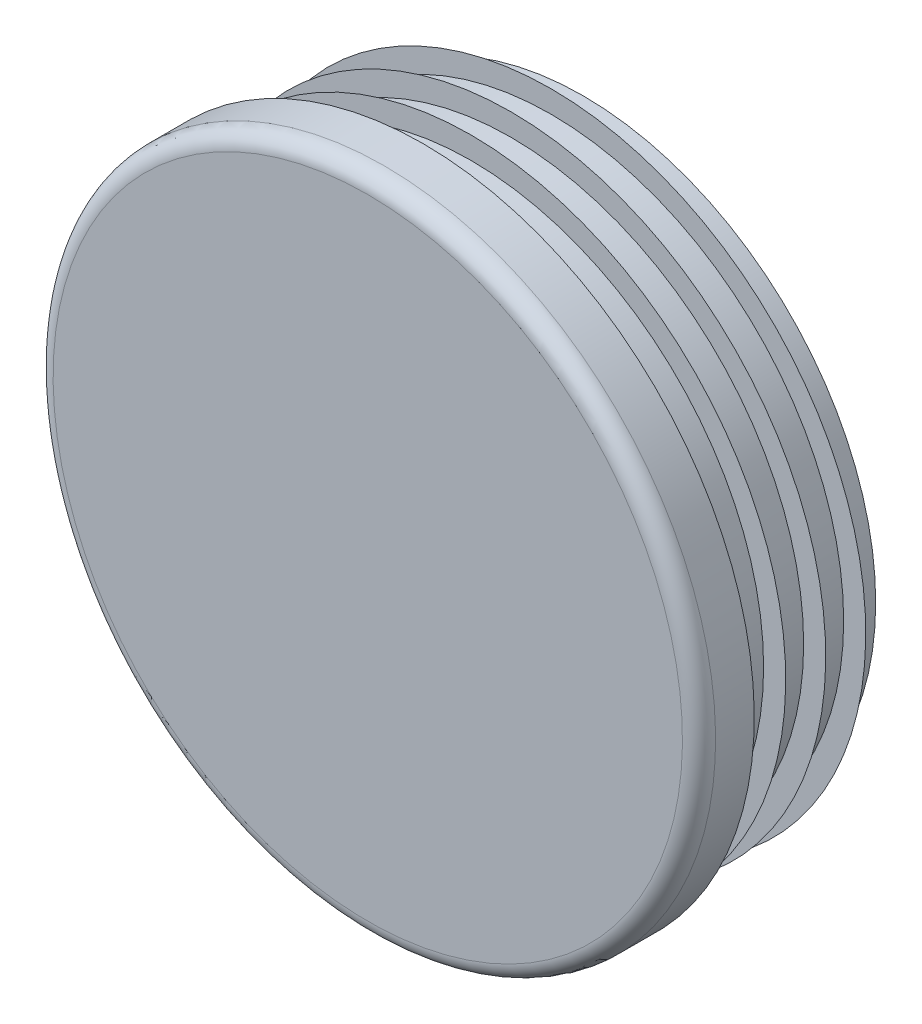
ISO-10303-21;
HEADER;
FILE_DESCRIPTION(('STEP AP214'),'2;1');
FILE_NAME('part.step','',(''),(''),'','','');
FILE_SCHEMA(('AUTOMOTIVE_DESIGN { 1 0 10303 214 1 1 1 1 }'));
ENDSEC;
DATA;
#1=APPLICATION_CONTEXT('core data for automotive mechanical design processes');
#2=APPLICATION_PROTOCOL_DEFINITION('international standard','automotive_design',2000,#1);
#3=PRODUCT_CONTEXT('',#1,'mechanical');
#4=PRODUCT('Part','Part','',(#3));
#5=PRODUCT_RELATED_PRODUCT_CATEGORY('part','',(#4));
#6=PRODUCT_DEFINITION_FORMATION('','',#4);
#7=PRODUCT_DEFINITION_CONTEXT('part definition',#1,'design');
#8=PRODUCT_DEFINITION('design','',#6,#7);
#9=PRODUCT_DEFINITION_SHAPE('','',#8);
#10=(LENGTH_UNIT() NAMED_UNIT(*) SI_UNIT(.MILLI.,.METRE.));
#11=(NAMED_UNIT(*) PLANE_ANGLE_UNIT() SI_UNIT($,.RADIAN.));
#12=(NAMED_UNIT(*) SI_UNIT($,.STERADIAN.) SOLID_ANGLE_UNIT());
#13=UNCERTAINTY_MEASURE_WITH_UNIT(LENGTH_MEASURE(1.E-05),#10,'distance_accuracy_value','');
#14=(GEOMETRIC_REPRESENTATION_CONTEXT(3) GLOBAL_UNCERTAINTY_ASSIGNED_CONTEXT((#13)) GLOBAL_UNIT_ASSIGNED_CONTEXT((#10,
#11,#12)) REPRESENTATION_CONTEXT('',''));
#15=CARTESIAN_POINT('',(0.,0.,0.));
#16=DIRECTION('',(0.,0.,1.));
#17=DIRECTION('',(1.,0.,0.));
#18=AXIS2_PLACEMENT_3D('',#15,#16,#17);
#19=CARTESIAN_POINT('',(0.,0.,5.));
#20=DIRECTION('',(0.,0.,-1.));
#21=DIRECTION('',(0.,1.,0.));
#22=AXIS2_PLACEMENT_3D('',#19,#20,#21);
#23=PLANE('',#22);
#24=CARTESIAN_POINT('',(0.,0.,5.));
#25=DIRECTION('',(0.,0.,-1.));
#26=DIRECTION('',(0.,1.,0.));
#27=AXIS2_PLACEMENT_3D('',#24,#25,#26);
#28=CIRCLE('',#27,28.5);
#29=CARTESIAN_POINT('',(0.,28.5,5.));
#30=VERTEX_POINT('',#29);
#31=EDGE_CURVE('E8',#30,#30,#28,.T.);
#32=ORIENTED_EDGE('',*,*,#31,.F.);
#33=EDGE_LOOP('',(#32));
#34=FACE_BOUND('',#33,.T.);
#35=ADVANCED_FACE('F12',(#34),#23,.F.);
#36=CARTESIAN_POINT('',(0.,0.,3.5));
#37=DIRECTION('',(0.,0.,-1.));
#38=DIRECTION('',(0.,1.,0.));
#39=AXIS2_PLACEMENT_3D('',#36,#37,#38);
#40=TOROIDAL_SURFACE('',#39,28.5,1.5);
#41=ORIENTED_EDGE('',*,*,#31,.T.);
#42=EDGE_LOOP('',(#41));
#43=FACE_BOUND('',#42,.T.);
#44=CARTESIAN_POINT('',(0.,0.,3.5));
#45=DIRECTION('',(0.,0.,-1.));
#46=DIRECTION('',(0.,1.,0.));
#47=AXIS2_PLACEMENT_3D('',#44,#45,#46);
#48=CIRCLE('',#47,30.);
#49=CARTESIAN_POINT('',(0.,30.,3.5));
#50=VERTEX_POINT('',#49);
#51=EDGE_CURVE('E18',#50,#50,#48,.T.);
#52=ORIENTED_EDGE('',*,*,#51,.F.);
#53=EDGE_LOOP('',(#52));
#54=FACE_BOUND('',#53,.T.);
#55=ADVANCED_FACE('F159',(#43,#54),#40,.T.);
#56=CARTESIAN_POINT('',(0.,0.,-14.5));
#57=DIRECTION('',(0.,0.,-1.));
#58=DIRECTION('',(0.,1.,0.));
#59=AXIS2_PLACEMENT_3D('',#56,#57,#58);
#60=CYLINDRICAL_SURFACE('',#59,30.);
#61=CARTESIAN_POINT('',(0.,0.,0.));
#62=DIRECTION('',(0.,0.,-1.));
#63=DIRECTION('',(0.,1.,0.));
#64=AXIS2_PLACEMENT_3D('',#61,#62,#63);
#65=CIRCLE('',#64,30.);
#66=CARTESIAN_POINT('',(0.,30.,0.));
#67=VERTEX_POINT('',#66);
#68=EDGE_CURVE('E22',#67,#67,#65,.T.);
#69=ORIENTED_EDGE('',*,*,#68,.F.);
#70=EDGE_LOOP('',(#69));
#71=FACE_BOUND('',#70,.T.);
#72=ORIENTED_EDGE('',*,*,#51,.T.);
#73=EDGE_LOOP('',(#72));
#74=FACE_BOUND('',#73,.T.);
#75=ADVANCED_FACE('F154',(#71,#74),#60,.T.);
#76=CARTESIAN_POINT('',(30.,0.,0.));
#77=DIRECTION('',(0.,0.,1.));
#78=DIRECTION('',(0.,-1.,0.));
#79=AXIS2_PLACEMENT_3D('',#76,#77,#78);
#80=PLANE('',#79);
#81=CARTESIAN_POINT('',(0.,0.,0.));
#82=DIRECTION('',(0.,0.,-1.));
#83=DIRECTION('',(0.,1.,0.));
#84=AXIS2_PLACEMENT_3D('',#81,#82,#83);
#85=CIRCLE('',#84,26.5);
#86=CARTESIAN_POINT('',(0.,26.5,0.));
#87=VERTEX_POINT('',#86);
#88=EDGE_CURVE('E26',#87,#87,#85,.T.);
#89=ORIENTED_EDGE('',*,*,#88,.F.);
#90=EDGE_LOOP('',(#89));
#91=FACE_BOUND('',#90,.T.);
#92=ORIENTED_EDGE('',*,*,#68,.T.);
#93=EDGE_LOOP('',(#92));
#94=FACE_BOUND('',#93,.T.);
#95=ADVANCED_FACE('F148',(#91,#94),#80,.F.);
#96=CARTESIAN_POINT('',(0.,0.,-14.5));
#97=DIRECTION('',(0.,0.,-1.));
#98=DIRECTION('',(0.,1.,0.));
#99=AXIS2_PLACEMENT_3D('',#96,#97,#98);
#100=CYLINDRICAL_SURFACE('',#99,26.5);
#101=CARTESIAN_POINT('',(0.,0.,-0.725));
#102=DIRECTION('',(0.,0.,-1.));
#103=DIRECTION('',(0.,1.,0.));
#104=AXIS2_PLACEMENT_3D('',#101,#102,#103);
#105=CIRCLE('',#104,26.5);
#106=CARTESIAN_POINT('',(0.,26.5,-0.725));
#107=VERTEX_POINT('',#106);
#108=EDGE_CURVE('E31',#107,#107,#105,.T.);
#109=ORIENTED_EDGE('',*,*,#108,.F.);
#110=EDGE_LOOP('',(#109));
#111=FACE_BOUND('',#110,.T.);
#112=ORIENTED_EDGE('',*,*,#88,.T.);
#113=EDGE_LOOP('',(#112));
#114=FACE_BOUND('',#113,.T.);
#115=ADVANCED_FACE('F142',(#111,#114),#100,.T.);
#116=CARTESIAN_POINT('',(26.5,0.,-0.725));
#117=DIRECTION('',(0.,0.,-1.));
#118=DIRECTION('',(0.,1.,0.));
#119=AXIS2_PLACEMENT_3D('',#116,#117,#118);
#120=PLANE('',#119);
#121=CARTESIAN_POINT('',(0.,0.,-0.725));
#122=DIRECTION('',(0.,0.,-1.));
#123=DIRECTION('',(0.,1.,0.));
#124=AXIS2_PLACEMENT_3D('',#121,#122,#123);
#125=CIRCLE('',#124,28.5);
#126=CARTESIAN_POINT('',(0.,28.5,-0.725));
#127=VERTEX_POINT('',#126);
#128=EDGE_CURVE('E34',#127,#127,#125,.T.);
#129=ORIENTED_EDGE('',*,*,#128,.F.);
#130=EDGE_LOOP('',(#129));
#131=FACE_BOUND('',#130,.T.);
#132=ORIENTED_EDGE('',*,*,#108,.T.);
#133=EDGE_LOOP('',(#132));
#134=FACE_BOUND('',#133,.T.);
#135=ADVANCED_FACE('F136',(#131,#134),#120,.F.);
#136=CARTESIAN_POINT('',(0.,0.,-0.725));
#137=DIRECTION('',(0.,0.,1.));
#138=DIRECTION('',(0.,-1.,0.));
#139=AXIS2_PLACEMENT_3D('',#136,#137,#138);
#140=CONICAL_SURFACE('',#139,28.5,0.959931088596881);
#141=CARTESIAN_POINT('',(0.,0.,-2.12541507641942));
#142=DIRECTION('',(0.,0.,-1.));
#143=DIRECTION('',(0.,1.,0.));
#144=AXIS2_PLACEMENT_3D('',#141,#142,#143);
#145=CIRCLE('',#144,26.5);
#146=CARTESIAN_POINT('',(0.,26.5,-2.12541507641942));
#147=VERTEX_POINT('',#146);
#148=EDGE_CURVE('E37',#147,#147,#145,.T.);
#149=ORIENTED_EDGE('',*,*,#148,.F.);
#150=EDGE_LOOP('',(#149));
#151=FACE_BOUND('',#150,.T.);
#152=ORIENTED_EDGE('',*,*,#128,.T.);
#153=EDGE_LOOP('',(#152));
#154=FACE_BOUND('',#153,.T.);
#155=ADVANCED_FACE('F130',(#151,#154),#140,.T.);
#156=CARTESIAN_POINT('',(0.,0.,-14.5));
#157=DIRECTION('',(0.,0.,-1.));
#158=DIRECTION('',(0.,1.,0.));
#159=AXIS2_PLACEMENT_3D('',#156,#157,#158);
#160=CYLINDRICAL_SURFACE('',#159,26.5);
#161=CARTESIAN_POINT('',(0.,0.,-4.35));
#162=DIRECTION('',(0.,0.,-1.));
#163=DIRECTION('',(0.,1.,0.));
#164=AXIS2_PLACEMENT_3D('',#161,#162,#163);
#165=CIRCLE('',#164,26.5);
#166=CARTESIAN_POINT('',(0.,26.5,-4.35));
#167=VERTEX_POINT('',#166);
#168=EDGE_CURVE('E40',#167,#167,#165,.T.);
#169=ORIENTED_EDGE('',*,*,#168,.F.);
#170=EDGE_LOOP('',(#169));
#171=FACE_BOUND('',#170,.T.);
#172=ORIENTED_EDGE('',*,*,#148,.T.);
#173=EDGE_LOOP('',(#172));
#174=FACE_BOUND('',#173,.T.);
#175=ADVANCED_FACE('F124',(#171,#174),#160,.T.);
#176=CARTESIAN_POINT('',(26.5,0.,-4.35));
#177=DIRECTION('',(0.,0.,-1.));
#178=DIRECTION('',(0.,1.,0.));
#179=AXIS2_PLACEMENT_3D('',#176,#177,#178);
#180=PLANE('',#179);
#181=CARTESIAN_POINT('',(0.,0.,-4.35));
#182=DIRECTION('',(0.,0.,-1.));
#183=DIRECTION('',(0.,1.,0.));
#184=AXIS2_PLACEMENT_3D('',#181,#182,#183);
#185=CIRCLE('',#184,28.5);
#186=CARTESIAN_POINT('',(0.,28.5,-4.35));
#187=VERTEX_POINT('',#186);
#188=EDGE_CURVE('E43',#187,#187,#185,.T.);
#189=ORIENTED_EDGE('',*,*,#188,.F.);
#190=EDGE_LOOP('',(#189));
#191=FACE_BOUND('',#190,.T.);
#192=ORIENTED_EDGE('',*,*,#168,.T.);
#193=EDGE_LOOP('',(#192));
#194=FACE_BOUND('',#193,.T.);
#195=ADVANCED_FACE('F118',(#191,#194),#180,.F.);
#196=CARTESIAN_POINT('',(0.,0.,-4.35));
#197=DIRECTION('',(0.,0.,1.));
#198=DIRECTION('',(0.,-1.,0.));
#199=AXIS2_PLACEMENT_3D('',#196,#197,#198);
#200=CONICAL_SURFACE('',#199,28.5,0.959931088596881);
#201=CARTESIAN_POINT('',(0.,0.,-5.75041507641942));
#202=DIRECTION('',(0.,0.,-1.));
#203=DIRECTION('',(0.,1.,0.));
#204=AXIS2_PLACEMENT_3D('',#201,#202,#203);
#205=CIRCLE('',#204,26.5);
#206=CARTESIAN_POINT('',(0.,26.5,-5.75041507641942));
#207=VERTEX_POINT('',#206);
#208=EDGE_CURVE('E46',#207,#207,#205,.T.);
#209=ORIENTED_EDGE('',*,*,#208,.F.);
#210=EDGE_LOOP('',(#209));
#211=FACE_BOUND('',#210,.T.);
#212=ORIENTED_EDGE('',*,*,#188,.T.);
#213=EDGE_LOOP('',(#212));
#214=FACE_BOUND('',#213,.T.);
#215=ADVANCED_FACE('F112',(#211,#214),#200,.T.);
#216=CARTESIAN_POINT('',(0.,0.,-14.5));
#217=DIRECTION('',(0.,0.,-1.));
#218=DIRECTION('',(0.,1.,0.));
#219=AXIS2_PLACEMENT_3D('',#216,#217,#218);
#220=CYLINDRICAL_SURFACE('',#219,26.5);
#221=CARTESIAN_POINT('',(0.,0.,-7.975));
#222=DIRECTION('',(0.,0.,-1.));
#223=DIRECTION('',(0.,1.,0.));
#224=AXIS2_PLACEMENT_3D('',#221,#222,#223);
#225=CIRCLE('',#224,26.5);
#226=CARTESIAN_POINT('',(0.,26.5,-7.975));
#227=VERTEX_POINT('',#226);
#228=EDGE_CURVE('E49',#227,#227,#225,.T.);
#229=ORIENTED_EDGE('',*,*,#228,.F.);
#230=EDGE_LOOP('',(#229));
#231=FACE_BOUND('',#230,.T.);
#232=ORIENTED_EDGE('',*,*,#208,.T.);
#233=EDGE_LOOP('',(#232));
#234=FACE_BOUND('',#233,.T.);
#235=ADVANCED_FACE('F106',(#231,#234),#220,.T.);
#236=CARTESIAN_POINT('',(26.5,0.,-7.975));
#237=DIRECTION('',(0.,0.,-1.));
#238=DIRECTION('',(0.,1.,0.));
#239=AXIS2_PLACEMENT_3D('',#236,#237,#238);
#240=PLANE('',#239);
#241=CARTESIAN_POINT('',(0.,0.,-7.975));
#242=DIRECTION('',(0.,0.,-1.));
#243=DIRECTION('',(0.,1.,0.));
#244=AXIS2_PLACEMENT_3D('',#241,#242,#243);
#245=CIRCLE('',#244,28.5);
#246=CARTESIAN_POINT('',(0.,28.5,-7.975));
#247=VERTEX_POINT('',#246);
#248=EDGE_CURVE('E52',#247,#247,#245,.T.);
#249=ORIENTED_EDGE('',*,*,#248,.F.);
#250=EDGE_LOOP('',(#249));
#251=FACE_BOUND('',#250,.T.);
#252=ORIENTED_EDGE('',*,*,#228,.T.);
#253=EDGE_LOOP('',(#252));
#254=FACE_BOUND('',#253,.T.);
#255=ADVANCED_FACE('F100',(#251,#254),#240,.F.);
#256=CARTESIAN_POINT('',(0.,0.,-7.975));
#257=DIRECTION('',(0.,0.,1.));
#258=DIRECTION('',(0.,-1.,0.));
#259=AXIS2_PLACEMENT_3D('',#256,#257,#258);
#260=CONICAL_SURFACE('',#259,28.5,0.959931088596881);
#261=CARTESIAN_POINT('',(0.,0.,-9.37541507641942));
#262=DIRECTION('',(0.,0.,-1.));
#263=DIRECTION('',(0.,1.,0.));
#264=AXIS2_PLACEMENT_3D('',#261,#262,#263);
#265=CIRCLE('',#264,26.5);
#266=CARTESIAN_POINT('',(0.,26.5,-9.37541507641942));
#267=VERTEX_POINT('',#266);
#268=EDGE_CURVE('E55',#267,#267,#265,.T.);
#269=ORIENTED_EDGE('',*,*,#268,.F.);
#270=EDGE_LOOP('',(#269));
#271=FACE_BOUND('',#270,.T.);
#272=ORIENTED_EDGE('',*,*,#248,.T.);
#273=EDGE_LOOP('',(#272));
#274=FACE_BOUND('',#273,.T.);
#275=ADVANCED_FACE('F94',(#271,#274),#260,.T.);
#276=CARTESIAN_POINT('',(0.,0.,-14.5));
#277=DIRECTION('',(0.,0.,-1.));
#278=DIRECTION('',(0.,1.,0.));
#279=AXIS2_PLACEMENT_3D('',#276,#277,#278);
#280=CYLINDRICAL_SURFACE('',#279,26.5);
#281=CARTESIAN_POINT('',(0.,0.,-11.6));
#282=DIRECTION('',(0.,0.,-1.));
#283=DIRECTION('',(0.,1.,0.));
#284=AXIS2_PLACEMENT_3D('',#281,#282,#283);
#285=CIRCLE('',#284,26.5);
#286=CARTESIAN_POINT('',(0.,26.5,-11.6));
#287=VERTEX_POINT('',#286);
#288=EDGE_CURVE('E58',#287,#287,#285,.T.);
#289=ORIENTED_EDGE('',*,*,#288,.F.);
#290=EDGE_LOOP('',(#289));
#291=FACE_BOUND('',#290,.T.);
#292=ORIENTED_EDGE('',*,*,#268,.T.);
#293=EDGE_LOOP('',(#292));
#294=FACE_BOUND('',#293,.T.);
#295=ADVANCED_FACE('F88',(#291,#294),#280,.T.);
#296=CARTESIAN_POINT('',(26.5,0.,-11.6));
#297=DIRECTION('',(0.,0.,-1.));
#298=DIRECTION('',(0.,1.,0.));
#299=AXIS2_PLACEMENT_3D('',#296,#297,#298);
#300=PLANE('',#299);
#301=CARTESIAN_POINT('',(0.,0.,-11.6));
#302=DIRECTION('',(0.,0.,-1.));
#303=DIRECTION('',(0.,1.,0.));
#304=AXIS2_PLACEMENT_3D('',#301,#302,#303);
#305=CIRCLE('',#304,28.5);
#306=CARTESIAN_POINT('',(0.,28.5,-11.6));
#307=VERTEX_POINT('',#306);
#308=EDGE_CURVE('E61',#307,#307,#305,.T.);
#309=ORIENTED_EDGE('',*,*,#308,.F.);
#310=EDGE_LOOP('',(#309));
#311=FACE_BOUND('',#310,.T.);
#312=ORIENTED_EDGE('',*,*,#288,.T.);
#313=EDGE_LOOP('',(#312));
#314=FACE_BOUND('',#313,.T.);
#315=ADVANCED_FACE('F82',(#311,#314),#300,.F.);
#316=CARTESIAN_POINT('',(0.,0.,-11.6));
#317=DIRECTION('',(0.,0.,1.));
#318=DIRECTION('',(0.,-1.,0.));
#319=AXIS2_PLACEMENT_3D('',#316,#317,#318);
#320=CONICAL_SURFACE('',#319,28.5,0.959931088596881);
#321=CARTESIAN_POINT('',(0.,0.,-13.0004150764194));
#322=DIRECTION('',(0.,0.,-1.));
#323=DIRECTION('',(0.,1.,0.));
#324=AXIS2_PLACEMENT_3D('',#321,#322,#323);
#325=CIRCLE('',#324,26.5);
#326=CARTESIAN_POINT('',(0.,26.5,-13.0004150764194));
#327=VERTEX_POINT('',#326);
#328=EDGE_CURVE('E64',#327,#327,#325,.T.);
#329=ORIENTED_EDGE('',*,*,#328,.F.);
#330=EDGE_LOOP('',(#329));
#331=FACE_BOUND('',#330,.T.);
#332=ORIENTED_EDGE('',*,*,#308,.T.);
#333=EDGE_LOOP('',(#332));
#334=FACE_BOUND('',#333,.T.);
#335=ADVANCED_FACE('F76',(#331,#334),#320,.T.);
#336=CARTESIAN_POINT('',(0.,0.,-14.5));
#337=DIRECTION('',(0.,0.,-1.));
#338=DIRECTION('',(0.,1.,0.));
#339=AXIS2_PLACEMENT_3D('',#336,#337,#338);
#340=CYLINDRICAL_SURFACE('',#339,26.5);
#341=CARTESIAN_POINT('',(0.,0.,-14.5));
#342=DIRECTION('',(0.,0.,-1.));
#343=DIRECTION('',(0.,1.,0.));
#344=AXIS2_PLACEMENT_3D('',#341,#342,#343);
#345=CIRCLE('',#344,26.5);
#346=CARTESIAN_POINT('',(0.,26.5,-14.5));
#347=VERTEX_POINT('',#346);
#348=EDGE_CURVE('E67',#347,#347,#345,.T.);
#349=ORIENTED_EDGE('',*,*,#348,.F.);
#350=EDGE_LOOP('',(#349));
#351=FACE_BOUND('',#350,.T.);
#352=ORIENTED_EDGE('',*,*,#328,.T.);
#353=EDGE_LOOP('',(#352));
#354=FACE_BOUND('',#353,.T.);
#355=ADVANCED_FACE('F73',(#351,#354),#340,.T.);
#356=CARTESIAN_POINT('',(26.5,0.,-14.5));
#357=DIRECTION('',(0.,0.,1.));
#358=DIRECTION('',(0.,-1.,0.));
#359=AXIS2_PLACEMENT_3D('',#356,#357,#358);
#360=PLANE('',#359);
#361=ORIENTED_EDGE('',*,*,#348,.T.);
#362=EDGE_LOOP('',(#361));
#363=FACE_BOUND('',#362,.T.);
#364=ADVANCED_FACE('F71',(#363),#360,.F.);
#365=CLOSED_SHELL('',(#35,#55,#75,#95,#115,#135,#155,#175,#195,#215,#235,#255,#275,#295,#315,
#335,#355,#364));
#366=MANIFOLD_SOLID_BREP('B1',#365);
#367=ADVANCED_BREP_SHAPE_REPRESENTATION('',(#18,#366),#14);
#368=SHAPE_DEFINITION_REPRESENTATION(#9,#367);
ENDSEC;
END-ISO-10303-21;
